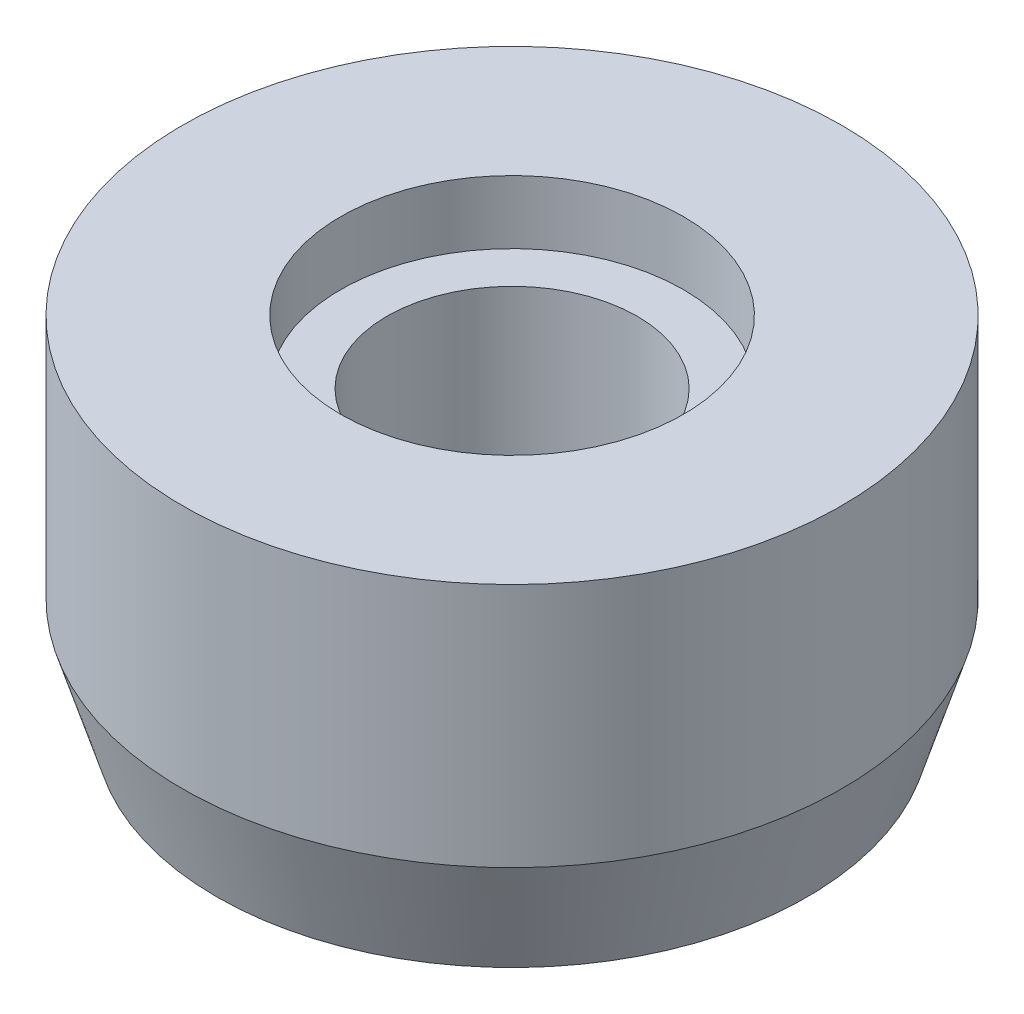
from build123d import *


with BuildPart() as part:
    # Sketch1 → Revolve1 (revolve)
    with BuildSketch(Plane.XY, mode=Mode.PRIVATE) as revolve1_sk:
        Polygon((12.5, 0), (6.5, 0), (6.5, -2.4), (4.75, -2.4), (4.75, -13.5), (11.2, -13.5), (12.5, -9.3), align=None)
    revolve(revolve1_sk.sketch.rotate(Axis((0, -13.5, 0), (0, 1, 0)), 90), axis=Axis((0, -13.5, 0), (0, 1, 0)))


solid = part.part
